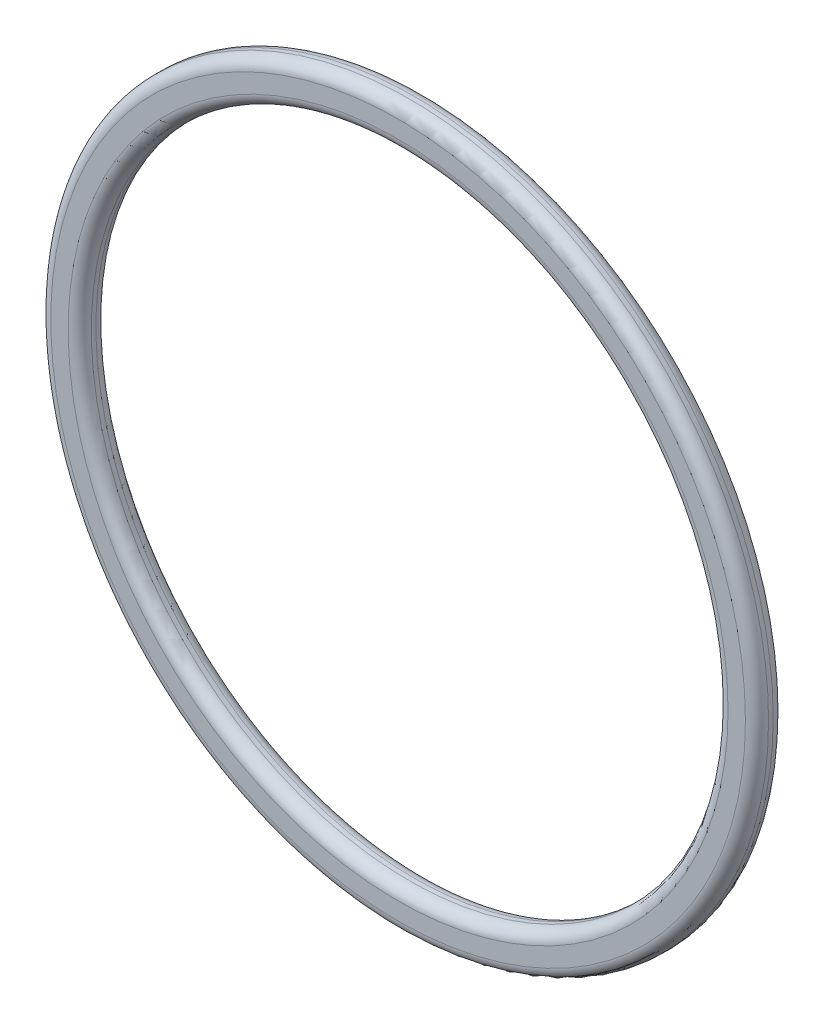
from build123d import *


with BuildPart() as part:
    # Esquisse1 → R_volution1 (revolve)
    with BuildSketch(Plane(origin=(0, 0, 0), x_dir=(0, 0, -1), z_dir=(1, 0, 0)), mode=Mode.PRIVATE) as r_volution1_sk:
        with BuildLine():
            Line((1.459361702, 31), (1.859361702, 31))
            ThreePointArc((1.859361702, 31), (2.566468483, 30.707106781), (2.859361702, 30))
            Line((2.859361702, 30), (2.859361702, 28.5))
            ThreePointArc((2.859361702, 28.5), (2.566468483, 27.792893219), (1.859361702, 27.5))
            Line((1.859361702, 27.5), (1.459361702, 27.5))
            ThreePointArc((1.459361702, 27.5), (0.752254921, 27.792893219), (0.459361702, 28.5))
            Line((0.459361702, 28.5), (0.459361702, 30))
            ThreePointArc((0.459361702, 30), (0.752254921, 30.707106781), (1.459361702, 31))
        make_face()
    revolve(r_volution1_sk.sketch.rotate(Axis((0, 0, 20.824397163), (0, 0, -1)), 90), axis=Axis((0, 0, 20.824397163), (0, 0, -1)))


solid = part.part
